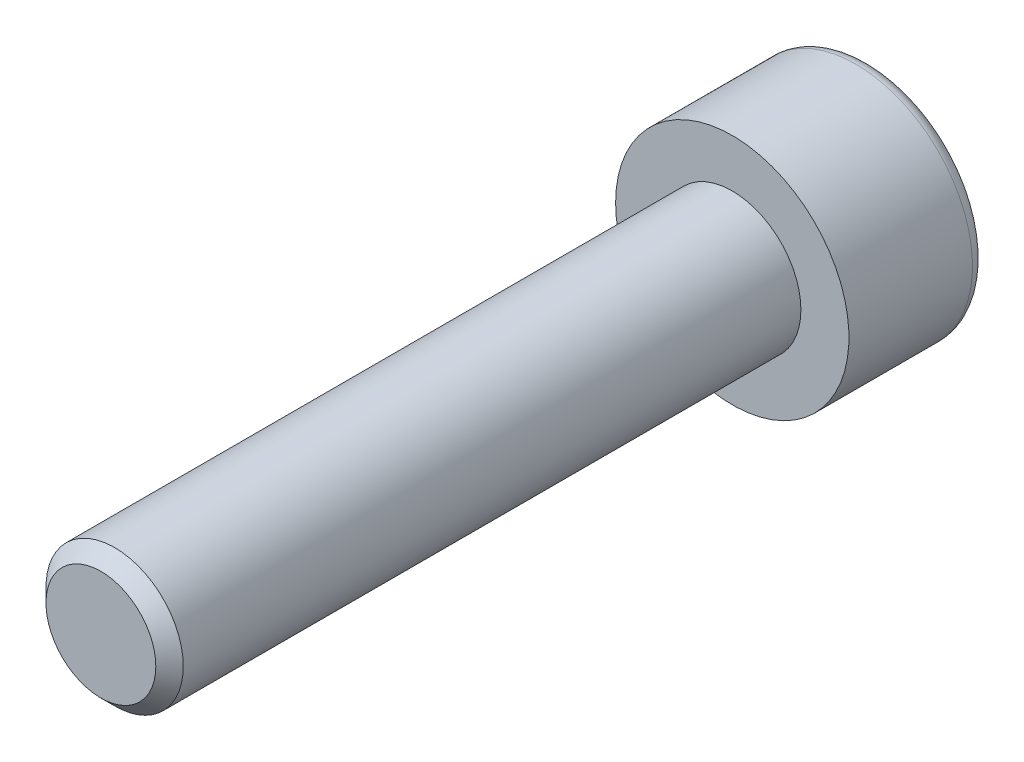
ISO-10303-21;
HEADER;
FILE_DESCRIPTION(('STEP AP214'),'2;1');
FILE_NAME('part.step','',(''),(''),'','','');
FILE_SCHEMA(('AUTOMOTIVE_DESIGN { 1 0 10303 214 1 1 1 1 }'));
ENDSEC;
DATA;
#1=APPLICATION_CONTEXT('core data for automotive mechanical design processes');
#2=APPLICATION_PROTOCOL_DEFINITION('international standard','automotive_design',2000,#1);
#3=PRODUCT_CONTEXT('',#1,'mechanical');
#4=PRODUCT('Part','Part','',(#3));
#5=PRODUCT_RELATED_PRODUCT_CATEGORY('part','',(#4));
#6=PRODUCT_DEFINITION_FORMATION('','',#4);
#7=PRODUCT_DEFINITION_CONTEXT('part definition',#1,'design');
#8=PRODUCT_DEFINITION('design','',#6,#7);
#9=PRODUCT_DEFINITION_SHAPE('','',#8);
#10=(LENGTH_UNIT() NAMED_UNIT(*) SI_UNIT(.MILLI.,.METRE.));
#11=(NAMED_UNIT(*) PLANE_ANGLE_UNIT() SI_UNIT($,.RADIAN.));
#12=(NAMED_UNIT(*) SI_UNIT($,.STERADIAN.) SOLID_ANGLE_UNIT());
#13=UNCERTAINTY_MEASURE_WITH_UNIT(LENGTH_MEASURE(1.E-05),#10,'distance_accuracy_value','');
#14=(GEOMETRIC_REPRESENTATION_CONTEXT(3) GLOBAL_UNCERTAINTY_ASSIGNED_CONTEXT((#13)) GLOBAL_UNIT_ASSIGNED_CONTEXT((#10,
#11,#12)) REPRESENTATION_CONTEXT('',''));
#15=CARTESIAN_POINT('',(0.,0.,0.));
#16=DIRECTION('',(0.,0.,1.));
#17=DIRECTION('',(1.,0.,0.));
#18=AXIS2_PLACEMENT_3D('',#15,#16,#17);
#19=CARTESIAN_POINT('',(0.,0.,-5.));
#20=DIRECTION('',(0.,0.,1.));
#21=DIRECTION('',(1.,0.,0.));
#22=AXIS2_PLACEMENT_3D('',#19,#20,#21);
#23=PLANE('',#22);
#24=CARTESIAN_POINT('',(0.,0.,-5.));
#25=DIRECTION('',(0.,0.,-1.));
#26=DIRECTION('',(-1.,0.,0.));
#27=AXIS2_PLACEMENT_3D('',#24,#25,#26);
#28=CIRCLE('',#27,3.75);
#29=CARTESIAN_POINT('',(-3.75,0.,-5.));
#30=VERTEX_POINT('',#29);
#31=EDGE_CURVE('E458',#30,#30,#28,.T.);
#32=ORIENTED_EDGE('',*,*,#31,.T.);
#33=EDGE_LOOP('',(#32));
#34=FACE_BOUND('',#33,.T.);
#35=DIRECTION('',(-0.86602540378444,0.499999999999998,0.));
#36=VECTOR('',#35,1.);
#37=CARTESIAN_POINT('',(0.,2.30940107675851,-5.));
#38=LINE('',#37,#36);
#39=CARTESIAN_POINT('',(2.,1.15470053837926,-5.));
#40=VERTEX_POINT('',#39);
#41=CARTESIAN_POINT('',(0.,2.30940107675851,-5.));
#42=VERTEX_POINT('',#41);
#43=EDGE_CURVE('E362',#40,#42,#38,.T.);
#44=ORIENTED_EDGE('',*,*,#43,.T.);
#45=DIRECTION('',(-0.866025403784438,-0.500000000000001,0.));
#46=VECTOR('',#45,1.);
#47=CARTESIAN_POINT('',(0.,2.30940107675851,-5.));
#48=LINE('',#47,#46);
#49=CARTESIAN_POINT('',(-2.,1.15470053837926,-5.));
#50=VERTEX_POINT('',#49);
#51=EDGE_CURVE('E402',#42,#50,#48,.T.);
#52=ORIENTED_EDGE('',*,*,#51,.T.);
#53=DIRECTION('',(0.,-1.,0.));
#54=VECTOR('',#53,1.);
#55=CARTESIAN_POINT('',(-2.,-1.15470053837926,-5.));
#56=LINE('',#55,#54);
#57=CARTESIAN_POINT('',(-2.,-1.15470053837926,-5.));
#58=VERTEX_POINT('',#57);
#59=EDGE_CURVE('E410',#50,#58,#56,.T.);
#60=ORIENTED_EDGE('',*,*,#59,.T.);
#61=DIRECTION('',(0.866025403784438,-0.500000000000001,0.));
#62=VECTOR('',#61,1.);
#63=CARTESIAN_POINT('',(0.,-2.30940107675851,-5.));
#64=LINE('',#63,#62);
#65=CARTESIAN_POINT('',(0.,-2.30940107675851,-5.));
#66=VERTEX_POINT('',#65);
#67=EDGE_CURVE('E428',#58,#66,#64,.T.);
#68=ORIENTED_EDGE('',*,*,#67,.T.);
#69=DIRECTION('',(0.86602540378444,0.499999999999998,0.));
#70=VECTOR('',#69,1.);
#71=CARTESIAN_POINT('',(0.,-2.30940107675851,-5.));
#72=LINE('',#71,#70);
#73=CARTESIAN_POINT('',(2.,-1.15470053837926,-5.));
#74=VERTEX_POINT('',#73);
#75=EDGE_CURVE('E431',#66,#74,#72,.T.);
#76=ORIENTED_EDGE('',*,*,#75,.T.);
#77=DIRECTION('',(0.,1.,0.));
#78=VECTOR('',#77,1.);
#79=CARTESIAN_POINT('',(2.,-1.15470053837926,-5.));
#80=LINE('',#79,#78);
#81=EDGE_CURVE('E421',#74,#40,#80,.T.);
#82=ORIENTED_EDGE('',*,*,#81,.T.);
#83=EDGE_LOOP('',(#44,#52,#60,#68,#76,#82));
#84=FACE_BOUND('',#83,.T.);
#85=ADVANCED_FACE('F348',(#34,#84),#23,.F.);
#86=CARTESIAN_POINT('',(0.,0.,-4.5));
#87=DIRECTION('',(0.,0.,-1.));
#88=DIRECTION('',(-1.,0.,0.));
#89=AXIS2_PLACEMENT_3D('',#86,#87,#88);
#90=TOROIDAL_SURFACE('',#89,3.75,0.5);
#91=ORIENTED_EDGE('',*,*,#31,.F.);
#92=EDGE_LOOP('',(#91));
#93=FACE_BOUND('',#92,.T.);
#94=CARTESIAN_POINT('',(0.,0.,-4.5));
#95=DIRECTION('',(0.,0.,-1.));
#96=DIRECTION('',(-1.,0.,0.));
#97=AXIS2_PLACEMENT_3D('',#94,#95,#96);
#98=CIRCLE('',#97,4.25);
#99=CARTESIAN_POINT('',(-4.25,0.,-4.5));
#100=VERTEX_POINT('',#99);
#101=EDGE_CURVE('E455',#100,#100,#98,.T.);
#102=ORIENTED_EDGE('',*,*,#101,.T.);
#103=EDGE_LOOP('',(#102));
#104=FACE_BOUND('',#103,.T.);
#105=ADVANCED_FACE('F477',(#93,#104),#90,.T.);
#106=CARTESIAN_POINT('',(0.,0.,0.));
#107=DIRECTION('',(0.,0.,-1.));
#108=DIRECTION('',(-1.,0.,0.));
#109=AXIS2_PLACEMENT_3D('',#106,#107,#108);
#110=CYLINDRICAL_SURFACE('',#109,4.25);
#111=ORIENTED_EDGE('',*,*,#101,.F.);
#112=EDGE_LOOP('',(#111));
#113=FACE_BOUND('',#112,.T.);
#114=CARTESIAN_POINT('',(0.,0.,0.));
#115=DIRECTION('',(0.,0.,-1.));
#116=DIRECTION('',(-1.,0.,0.));
#117=AXIS2_PLACEMENT_3D('',#114,#115,#116);
#118=CIRCLE('',#117,4.25);
#119=CARTESIAN_POINT('',(-4.25,0.,0.));
#120=VERTEX_POINT('',#119);
#121=EDGE_CURVE('E416',#120,#120,#118,.T.);
#122=ORIENTED_EDGE('',*,*,#121,.T.);
#123=EDGE_LOOP('',(#122));
#124=FACE_BOUND('',#123,.T.);
#125=ADVANCED_FACE('F482',(#113,#124),#110,.T.);
#126=CARTESIAN_POINT('',(0.,0.,0.));
#127=DIRECTION('',(0.,0.,-1.));
#128=DIRECTION('',(-1.,0.,0.));
#129=AXIS2_PLACEMENT_3D('',#126,#127,#128);
#130=PLANE('',#129);
#131=CARTESIAN_POINT('',(0.,0.,0.));
#132=DIRECTION('',(0.,0.,1.));
#133=DIRECTION('',(1.,0.,0.));
#134=AXIS2_PLACEMENT_3D('',#131,#132,#133);
#135=CIRCLE('',#134,2.5);
#136=CARTESIAN_POINT('',(2.5,0.,0.));
#137=VERTEX_POINT('',#136);
#138=EDGE_CURVE('E422',#137,#137,#135,.T.);
#139=ORIENTED_EDGE('',*,*,#138,.F.);
#140=EDGE_LOOP('',(#139));
#141=FACE_BOUND('',#140,.T.);
#142=ORIENTED_EDGE('',*,*,#121,.F.);
#143=EDGE_LOOP('',(#142));
#144=FACE_BOUND('',#143,.T.);
#145=ADVANCED_FACE('F490',(#141,#144),#130,.F.);
#146=CARTESIAN_POINT('',(0.,2.30940107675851,-2.3));
#147=DIRECTION('',(-0.499999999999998,-0.86602540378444,0.));
#148=DIRECTION('',(0.86602540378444,-0.499999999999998,0.));
#149=AXIS2_PLACEMENT_3D('',#146,#147,#148);
#150=PLANE('',#149);
#151=ORIENTED_EDGE('',*,*,#43,.F.);
#152=DIRECTION('',(0.,0.,-1.));
#153=VECTOR('',#152,1.);
#154=CARTESIAN_POINT('',(2.,1.15470053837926,-2.3));
#155=LINE('',#154,#153);
#156=CARTESIAN_POINT('',(2.,1.15470053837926,-2.3));
#157=VERTEX_POINT('',#156);
#158=EDGE_CURVE('E444',#157,#40,#155,.T.);
#159=ORIENTED_EDGE('',*,*,#158,.F.);
#160=DIRECTION('',(-0.86602540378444,0.499999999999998,0.));
#161=VECTOR('',#160,1.);
#162=CARTESIAN_POINT('',(0.,2.30940107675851,-2.3));
#163=LINE('',#162,#161);
#164=CARTESIAN_POINT('',(0.,2.30940107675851,-2.3));
#165=VERTEX_POINT('',#164);
#166=EDGE_CURVE('E415',#157,#165,#163,.T.);
#167=ORIENTED_EDGE('',*,*,#166,.T.);
#168=DIRECTION('',(0.,0.,-1.));
#169=VECTOR('',#168,1.);
#170=CARTESIAN_POINT('',(0.,2.30940107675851,-2.3));
#171=LINE('',#170,#169);
#172=EDGE_CURVE('E404',#165,#42,#171,.T.);
#173=ORIENTED_EDGE('',*,*,#172,.T.);
#174=EDGE_LOOP('',(#151,#159,#167,#173));
#175=FACE_BOUND('',#174,.T.);
#176=ADVANCED_FACE('F413',(#175),#150,.T.);
#177=CARTESIAN_POINT('',(0.,2.30940107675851,-2.3));
#178=DIRECTION('',(0.500000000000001,-0.866025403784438,0.));
#179=DIRECTION('',(0.866025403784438,0.500000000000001,0.));
#180=AXIS2_PLACEMENT_3D('',#177,#178,#179);
#181=PLANE('',#180);
#182=ORIENTED_EDGE('',*,*,#51,.F.);
#183=ORIENTED_EDGE('',*,*,#172,.F.);
#184=DIRECTION('',(-0.866025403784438,-0.500000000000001,0.));
#185=VECTOR('',#184,1.);
#186=CARTESIAN_POINT('',(0.,2.30940107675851,-2.3));
#187=LINE('',#186,#185);
#188=CARTESIAN_POINT('',(-2.,1.15470053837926,-2.3));
#189=VERTEX_POINT('',#188);
#190=EDGE_CURVE('E435',#165,#189,#187,.T.);
#191=ORIENTED_EDGE('',*,*,#190,.T.);
#192=DIRECTION('',(0.,0.,-1.));
#193=VECTOR('',#192,1.);
#194=CARTESIAN_POINT('',(-2.,1.15470053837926,-2.3));
#195=LINE('',#194,#193);
#196=EDGE_CURVE('E406',#189,#50,#195,.T.);
#197=ORIENTED_EDGE('',*,*,#196,.T.);
#198=EDGE_LOOP('',(#182,#183,#191,#197));
#199=FACE_BOUND('',#198,.T.);
#200=ADVANCED_FACE('F403',(#199),#181,.T.);
#201=CARTESIAN_POINT('',(-2.,-1.15470053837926,-2.3));
#202=DIRECTION('',(1.,0.,0.));
#203=DIRECTION('',(0.,0.,-1.));
#204=AXIS2_PLACEMENT_3D('',#201,#202,#203);
#205=PLANE('',#204);
#206=ORIENTED_EDGE('',*,*,#59,.F.);
#207=ORIENTED_EDGE('',*,*,#196,.F.);
#208=DIRECTION('',(0.,-1.,0.));
#209=VECTOR('',#208,1.);
#210=CARTESIAN_POINT('',(-2.,-1.15470053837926,-2.3));
#211=LINE('',#210,#209);
#212=CARTESIAN_POINT('',(-2.,-1.15470053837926,-2.3));
#213=VERTEX_POINT('',#212);
#214=EDGE_CURVE('E437',#189,#213,#211,.T.);
#215=ORIENTED_EDGE('',*,*,#214,.T.);
#216=DIRECTION('',(0.,0.,-1.));
#217=VECTOR('',#216,1.);
#218=CARTESIAN_POINT('',(-2.,-1.15470053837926,-2.3));
#219=LINE('',#218,#217);
#220=EDGE_CURVE('E450',#213,#58,#219,.T.);
#221=ORIENTED_EDGE('',*,*,#220,.T.);
#222=EDGE_LOOP('',(#206,#207,#215,#221));
#223=FACE_BOUND('',#222,.T.);
#224=ADVANCED_FACE('F505',(#223),#205,.T.);
#225=CARTESIAN_POINT('',(0.,-2.30940107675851,-2.3));
#226=DIRECTION('',(0.500000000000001,0.866025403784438,0.));
#227=DIRECTION('',(-0.866025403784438,0.500000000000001,0.));
#228=AXIS2_PLACEMENT_3D('',#225,#226,#227);
#229=PLANE('',#228);
#230=ORIENTED_EDGE('',*,*,#67,.F.);
#231=ORIENTED_EDGE('',*,*,#220,.F.);
#232=DIRECTION('',(0.866025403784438,-0.500000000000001,0.));
#233=VECTOR('',#232,1.);
#234=CARTESIAN_POINT('',(0.,-2.30940107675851,-2.3));
#235=LINE('',#234,#233);
#236=CARTESIAN_POINT('',(0.,-2.30940107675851,-2.3));
#237=VERTEX_POINT('',#236);
#238=EDGE_CURVE('E439',#213,#237,#235,.T.);
#239=ORIENTED_EDGE('',*,*,#238,.T.);
#240=DIRECTION('',(0.,0.,-1.));
#241=VECTOR('',#240,1.);
#242=CARTESIAN_POINT('',(0.,-2.30940107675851,-2.3));
#243=LINE('',#242,#241);
#244=EDGE_CURVE('E448',#237,#66,#243,.T.);
#245=ORIENTED_EDGE('',*,*,#244,.T.);
#246=EDGE_LOOP('',(#230,#231,#239,#245));
#247=FACE_BOUND('',#246,.T.);
#248=ADVANCED_FACE('F508',(#247),#229,.T.);
#249=CARTESIAN_POINT('',(0.,-2.30940107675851,-2.3));
#250=DIRECTION('',(-0.499999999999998,0.86602540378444,0.));
#251=DIRECTION('',(-0.86602540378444,-0.499999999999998,0.));
#252=AXIS2_PLACEMENT_3D('',#249,#250,#251);
#253=PLANE('',#252);
#254=ORIENTED_EDGE('',*,*,#75,.F.);
#255=ORIENTED_EDGE('',*,*,#244,.F.);
#256=DIRECTION('',(0.86602540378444,0.499999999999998,0.));
#257=VECTOR('',#256,1.);
#258=CARTESIAN_POINT('',(0.,-2.30940107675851,-2.3));
#259=LINE('',#258,#257);
#260=CARTESIAN_POINT('',(2.,-1.15470053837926,-2.3));
#261=VERTEX_POINT('',#260);
#262=EDGE_CURVE('E441',#237,#261,#259,.T.);
#263=ORIENTED_EDGE('',*,*,#262,.T.);
#264=DIRECTION('',(0.,0.,-1.));
#265=VECTOR('',#264,1.);
#266=CARTESIAN_POINT('',(2.,-1.15470053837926,-2.3));
#267=LINE('',#266,#265);
#268=EDGE_CURVE('E446',#261,#74,#267,.T.);
#269=ORIENTED_EDGE('',*,*,#268,.T.);
#270=EDGE_LOOP('',(#254,#255,#263,#269));
#271=FACE_BOUND('',#270,.T.);
#272=ADVANCED_FACE('F512',(#271),#253,.T.);
#273=CARTESIAN_POINT('',(2.,-1.15470053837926,-2.3));
#274=DIRECTION('',(-1.,0.,0.));
#275=DIRECTION('',(0.,0.,1.));
#276=AXIS2_PLACEMENT_3D('',#273,#274,#275);
#277=PLANE('',#276);
#278=ORIENTED_EDGE('',*,*,#81,.F.);
#279=ORIENTED_EDGE('',*,*,#268,.F.);
#280=DIRECTION('',(0.,1.,0.));
#281=VECTOR('',#280,1.);
#282=CARTESIAN_POINT('',(2.,-1.15470053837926,-2.3));
#283=LINE('',#282,#281);
#284=EDGE_CURVE('E369',#261,#157,#283,.T.);
#285=ORIENTED_EDGE('',*,*,#284,.T.);
#286=ORIENTED_EDGE('',*,*,#158,.T.);
#287=EDGE_LOOP('',(#278,#279,#285,#286));
#288=FACE_BOUND('',#287,.T.);
#289=ADVANCED_FACE('F516',(#288),#277,.T.);
#290=CARTESIAN_POINT('',(2.,1.15470053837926,-2.3));
#291=DIRECTION('',(0.,0.,1.));
#292=DIRECTION('',(1.,0.,0.));
#293=AXIS2_PLACEMENT_3D('',#290,#291,#292);
#294=PLANE('',#293);
#295=ORIENTED_EDGE('',*,*,#166,.F.);
#296=ORIENTED_EDGE('',*,*,#284,.F.);
#297=ORIENTED_EDGE('',*,*,#262,.F.);
#298=ORIENTED_EDGE('',*,*,#238,.F.);
#299=ORIENTED_EDGE('',*,*,#214,.F.);
#300=ORIENTED_EDGE('',*,*,#190,.F.);
#301=EDGE_LOOP('',(#295,#296,#297,#298,#299,#300));
#302=FACE_BOUND('',#301,.T.);
#303=ADVANCED_FACE('F520',(#302),#294,.F.);
#304=CARTESIAN_POINT('',(0.,0.,23.));
#305=DIRECTION('',(0.,0.,1.));
#306=DIRECTION('',(1.,0.,0.));
#307=AXIS2_PLACEMENT_3D('',#304,#305,#306);
#308=PLANE('',#307);
#309=CARTESIAN_POINT('',(0.,0.,23.));
#310=DIRECTION('',(0.,0.,1.));
#311=DIRECTION('',(1.,0.,0.));
#312=AXIS2_PLACEMENT_3D('',#309,#310,#311);
#313=CIRCLE('',#312,2.);
#314=CARTESIAN_POINT('',(2.,0.,23.));
#315=VERTEX_POINT('',#314);
#316=EDGE_CURVE('E355',#315,#315,#313,.T.);
#317=ORIENTED_EDGE('',*,*,#316,.T.);
#318=EDGE_LOOP('',(#317));
#319=FACE_BOUND('',#318,.T.);
#320=ADVANCED_FACE('F463',(#319),#308,.T.);
#321=CARTESIAN_POINT('',(0.,0.,0.));
#322=DIRECTION('',(0.,0.,1.));
#323=DIRECTION('',(1.,0.,0.));
#324=AXIS2_PLACEMENT_3D('',#321,#322,#323);
#325=CYLINDRICAL_SURFACE('',#324,2.5);
#326=CARTESIAN_POINT('',(0.,0.,22.5));
#327=DIRECTION('',(0.,0.,1.));
#328=DIRECTION('',(1.,0.,0.));
#329=AXIS2_PLACEMENT_3D('',#326,#327,#328);
#330=CIRCLE('',#329,2.5);
#331=CARTESIAN_POINT('',(2.5,0.,22.5));
#332=VERTEX_POINT('',#331);
#333=EDGE_CURVE('E11',#332,#332,#330,.F.);
#334=ORIENTED_EDGE('',*,*,#333,.T.);
#335=EDGE_LOOP('',(#334));
#336=FACE_BOUND('',#335,.T.);
#337=ORIENTED_EDGE('',*,*,#138,.T.);
#338=EDGE_LOOP('',(#337));
#339=FACE_BOUND('',#338,.T.);
#340=ADVANCED_FACE('F467',(#336,#339),#325,.T.);
#341=CARTESIAN_POINT('',(0.,0.,23.));
#342=DIRECTION('',(0.,0.,-1.));
#343=DIRECTION('',(-1.,0.,0.));
#344=AXIS2_PLACEMENT_3D('',#341,#342,#343);
#345=CONICAL_SURFACE('',#344,2.,0.785398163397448);
#346=ORIENTED_EDGE('',*,*,#333,.F.);
#347=EDGE_LOOP('',(#346));
#348=FACE_BOUND('',#347,.T.);
#349=ORIENTED_EDGE('',*,*,#316,.F.);
#350=EDGE_LOOP('',(#349));
#351=FACE_BOUND('',#350,.T.);
#352=ADVANCED_FACE('F465',(#348,#351),#345,.T.);
#353=CLOSED_SHELL('',(#85,#105,#125,#145,#176,#200,#224,#248,#272,#289,#303,#320,#340,#352));
#354=MANIFOLD_SOLID_BREP('B2',#353);
#355=ADVANCED_BREP_SHAPE_REPRESENTATION('',(#18,#354),#14);
#356=SHAPE_DEFINITION_REPRESENTATION(#9,#355);
ENDSEC;
END-ISO-10303-21;
